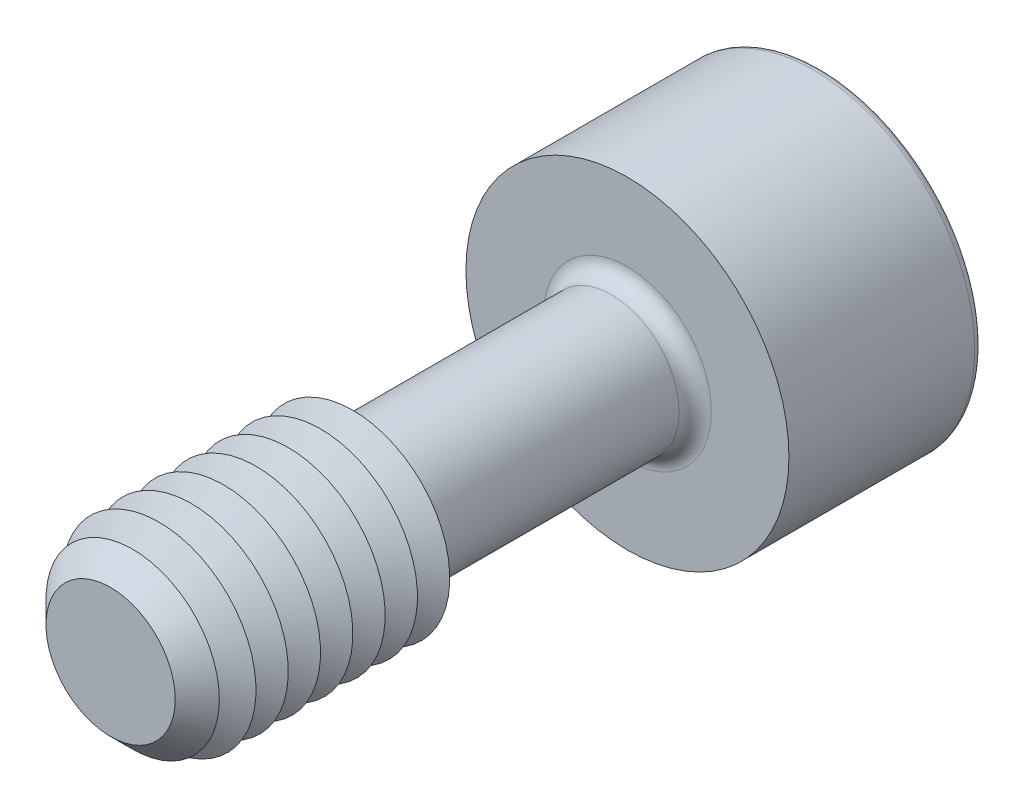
ISO-10303-21;
HEADER;
FILE_DESCRIPTION(('STEP AP214'),'2;1');
FILE_NAME('part.step','',(''),(''),'','','');
FILE_SCHEMA(('AUTOMOTIVE_DESIGN { 1 0 10303 214 1 1 1 1 }'));
ENDSEC;
DATA;
#1=APPLICATION_CONTEXT('core data for automotive mechanical design processes');
#2=APPLICATION_PROTOCOL_DEFINITION('international standard','automotive_design',2000,#1);
#3=PRODUCT_CONTEXT('',#1,'mechanical');
#4=PRODUCT('Part','Part','',(#3));
#5=PRODUCT_RELATED_PRODUCT_CATEGORY('part','',(#4));
#6=PRODUCT_DEFINITION_FORMATION('','',#4);
#7=PRODUCT_DEFINITION_CONTEXT('part definition',#1,'design');
#8=PRODUCT_DEFINITION('design','',#6,#7);
#9=PRODUCT_DEFINITION_SHAPE('','',#8);
#10=(LENGTH_UNIT() NAMED_UNIT(*) SI_UNIT(.MILLI.,.METRE.));
#11=(NAMED_UNIT(*) PLANE_ANGLE_UNIT() SI_UNIT($,.RADIAN.));
#12=(NAMED_UNIT(*) SI_UNIT($,.STERADIAN.) SOLID_ANGLE_UNIT());
#13=UNCERTAINTY_MEASURE_WITH_UNIT(LENGTH_MEASURE(1.E-05),#10,'distance_accuracy_value','');
#14=(GEOMETRIC_REPRESENTATION_CONTEXT(3) GLOBAL_UNCERTAINTY_ASSIGNED_CONTEXT((#13)) GLOBAL_UNIT_ASSIGNED_CONTEXT((#10,
#11,#12)) REPRESENTATION_CONTEXT('',''));
#15=CARTESIAN_POINT('',(0.,0.,0.));
#16=DIRECTION('',(0.,0.,1.));
#17=DIRECTION('',(1.,0.,0.));
#18=AXIS2_PLACEMENT_3D('',#15,#16,#17);
#19=CARTESIAN_POINT('',(-1.44337567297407,-2.5,-9.));
#20=DIRECTION('',(0.,0.,1.));
#21=DIRECTION('',(1.,0.,0.));
#22=AXIS2_PLACEMENT_3D('',#19,#20,#21);
#23=PLANE('',#22);
#24=DIRECTION('',(1.,0.,0.));
#25=VECTOR('',#24,1.);
#26=CARTESIAN_POINT('',(-1.44337567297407,-2.5,-9.));
#27=LINE('',#26,#25);
#28=CARTESIAN_POINT('',(0.,-2.5,-9.));
#29=VERTEX_POINT('',#28);
#30=CARTESIAN_POINT('',(1.44337567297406,-2.5,-9.));
#31=VERTEX_POINT('',#30);
#32=EDGE_CURVE('E729',#29,#31,#27,.T.);
#33=ORIENTED_EDGE('',*,*,#32,.F.);
#34=CARTESIAN_POINT('',(0.,0.,-9.));
#35=DIRECTION('',(0.,0.,1.));
#36=DIRECTION('',(0.,-1.,0.));
#37=AXIS2_PLACEMENT_3D('',#34,#35,#36);
#38=CIRCLE('',#37,2.5);
#39=CARTESIAN_POINT('',(2.1650635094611,-1.25,-9.));
#40=VERTEX_POINT('',#39);
#41=EDGE_CURVE('E53',#29,#40,#38,.T.);
#42=ORIENTED_EDGE('',*,*,#41,.T.);
#43=DIRECTION('',(0.5,0.866025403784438,0.));
#44=VECTOR('',#43,1.);
#45=CARTESIAN_POINT('',(1.44337567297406,-2.5,-9.));
#46=LINE('',#45,#44);
#47=EDGE_CURVE('E714',#31,#40,#46,.T.);
#48=ORIENTED_EDGE('',*,*,#47,.F.);
#49=EDGE_LOOP('',(#33,#42,#48));
#50=FACE_BOUND('',#49,.T.);
#51=ADVANCED_FACE('F41',(#50),#23,.F.);
#52=CARTESIAN_POINT('',(2.88675134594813,0.,-9.));
#53=VERTEX_POINT('',#52);
#54=EDGE_CURVE('E725',#40,#53,#46,.T.);
#55=ORIENTED_EDGE('',*,*,#54,.F.);
#56=CARTESIAN_POINT('',(2.1650635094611,1.25,-9.));
#57=VERTEX_POINT('',#56);
#58=EDGE_CURVE('E11',#40,#57,#38,.T.);
#59=ORIENTED_EDGE('',*,*,#58,.T.);
#60=DIRECTION('',(-0.5,0.866025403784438,0.));
#61=VECTOR('',#60,1.);
#62=CARTESIAN_POINT('',(2.88675134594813,0.,-9.));
#63=LINE('',#62,#61);
#64=EDGE_CURVE('E713',#53,#57,#63,.T.);
#65=ORIENTED_EDGE('',*,*,#64,.F.);
#66=EDGE_LOOP('',(#55,#59,#65));
#67=FACE_BOUND('',#66,.T.);
#68=ADVANCED_FACE('F133',(#67),#23,.F.);
#69=CARTESIAN_POINT('',(1.44337567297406,2.5,-9.));
#70=VERTEX_POINT('',#69);
#71=EDGE_CURVE('E708',#57,#70,#63,.T.);
#72=ORIENTED_EDGE('',*,*,#71,.F.);
#73=CARTESIAN_POINT('',(0.,2.5,-8.99999999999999));
#74=VERTEX_POINT('',#73);
#75=EDGE_CURVE('E51',#57,#74,#38,.T.);
#76=ORIENTED_EDGE('',*,*,#75,.T.);
#77=DIRECTION('',(-1.,0.,0.));
#78=VECTOR('',#77,1.);
#79=CARTESIAN_POINT('',(1.44337567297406,2.5,-9.));
#80=LINE('',#79,#78);
#81=EDGE_CURVE('E177',#70,#74,#80,.T.);
#82=ORIENTED_EDGE('',*,*,#81,.F.);
#83=EDGE_LOOP('',(#72,#76,#82));
#84=FACE_BOUND('',#83,.T.);
#85=ADVANCED_FACE('F139',(#84),#23,.F.);
#86=CARTESIAN_POINT('',(-1.44337567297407,2.5,-9.));
#87=VERTEX_POINT('',#86);
#88=EDGE_CURVE('E719',#74,#87,#80,.T.);
#89=ORIENTED_EDGE('',*,*,#88,.F.);
#90=CARTESIAN_POINT('',(-2.1650635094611,1.25,-9.));
#91=VERTEX_POINT('',#90);
#92=EDGE_CURVE('E264',#74,#91,#38,.T.);
#93=ORIENTED_EDGE('',*,*,#92,.T.);
#94=DIRECTION('',(-0.5,-0.866025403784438,0.));
#95=VECTOR('',#94,1.);
#96=CARTESIAN_POINT('',(-1.44337567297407,2.5,-9.));
#97=LINE('',#96,#95);
#98=EDGE_CURVE('E176',#87,#91,#97,.T.);
#99=ORIENTED_EDGE('',*,*,#98,.F.);
#100=EDGE_LOOP('',(#89,#93,#99));
#101=FACE_BOUND('',#100,.T.);
#102=ADVANCED_FACE('F157',(#101),#23,.F.);
#103=CARTESIAN_POINT('',(-2.88675134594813,0.,-9.));
#104=VERTEX_POINT('',#103);
#105=EDGE_CURVE('E170',#91,#104,#97,.T.);
#106=ORIENTED_EDGE('',*,*,#105,.F.);
#107=CARTESIAN_POINT('',(-2.1650635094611,-1.25,-9.));
#108=VERTEX_POINT('',#107);
#109=EDGE_CURVE('E172',#91,#108,#38,.T.);
#110=ORIENTED_EDGE('',*,*,#109,.T.);
#111=DIRECTION('',(0.5,-0.866025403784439,0.));
#112=VECTOR('',#111,1.);
#113=CARTESIAN_POINT('',(-2.88675134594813,0.,-9.));
#114=LINE('',#113,#112);
#115=EDGE_CURVE('E174',#104,#108,#114,.T.);
#116=ORIENTED_EDGE('',*,*,#115,.F.);
#117=EDGE_LOOP('',(#106,#110,#116));
#118=FACE_BOUND('',#117,.T.);
#119=ADVANCED_FACE('F146',(#118),#23,.F.);
#120=CARTESIAN_POINT('',(0.,0.,-14.));
#121=DIRECTION('',(0.,0.,-1.));
#122=DIRECTION('',(-1.,0.,0.));
#123=AXIS2_PLACEMENT_3D('',#120,#121,#122);
#124=PLANE('',#123);
#125=CARTESIAN_POINT('',(0.,0.,-14.));
#126=DIRECTION('',(0.,0.,-1.));
#127=DIRECTION('',(-1.,0.,0.));
#128=AXIS2_PLACEMENT_3D('',#125,#126,#127);
#129=CIRCLE('',#128,4.75);
#130=CARTESIAN_POINT('',(-4.75,0.,-14.));
#131=VERTEX_POINT('',#130);
#132=EDGE_CURVE('E250',#131,#131,#129,.T.);
#133=ORIENTED_EDGE('',*,*,#132,.T.);
#134=EDGE_LOOP('',(#133));
#135=FACE_BOUND('',#134,.T.);
#136=DIRECTION('',(-0.5,-0.866025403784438,0.));
#137=VECTOR('',#136,1.);
#138=CARTESIAN_POINT('',(-1.44337567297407,2.5,-14.));
#139=LINE('',#138,#137);
#140=CARTESIAN_POINT('',(-1.44337567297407,2.5,-14.));
#141=VERTEX_POINT('',#140);
#142=CARTESIAN_POINT('',(-2.88675134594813,0.,-14.));
#143=VERTEX_POINT('',#142);
#144=EDGE_CURVE('E212',#141,#143,#139,.T.);
#145=ORIENTED_EDGE('',*,*,#144,.T.);
#146=DIRECTION('',(0.5,-0.866025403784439,0.));
#147=VECTOR('',#146,1.);
#148=CARTESIAN_POINT('',(-2.88675134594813,0.,-14.));
#149=LINE('',#148,#147);
#150=CARTESIAN_POINT('',(-1.44337567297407,-2.5,-14.));
#151=VERTEX_POINT('',#150);
#152=EDGE_CURVE('E67',#143,#151,#149,.T.);
#153=ORIENTED_EDGE('',*,*,#152,.T.);
#154=DIRECTION('',(1.,0.,0.));
#155=VECTOR('',#154,1.);
#156=CARTESIAN_POINT('',(-1.44337567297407,-2.5,-14.));
#157=LINE('',#156,#155);
#158=CARTESIAN_POINT('',(1.44337567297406,-2.5,-14.));
#159=VERTEX_POINT('',#158);
#160=EDGE_CURVE('E196',#151,#159,#157,.T.);
#161=ORIENTED_EDGE('',*,*,#160,.T.);
#162=DIRECTION('',(0.5,0.866025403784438,0.));
#163=VECTOR('',#162,1.);
#164=CARTESIAN_POINT('',(1.44337567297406,-2.5,-14.));
#165=LINE('',#164,#163);
#166=CARTESIAN_POINT('',(2.88675134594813,0.,-14.));
#167=VERTEX_POINT('',#166);
#168=EDGE_CURVE('E200',#159,#167,#165,.T.);
#169=ORIENTED_EDGE('',*,*,#168,.T.);
#170=DIRECTION('',(-0.5,0.866025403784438,0.));
#171=VECTOR('',#170,1.);
#172=CARTESIAN_POINT('',(2.88675134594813,0.,-14.));
#173=LINE('',#172,#171);
#174=CARTESIAN_POINT('',(1.44337567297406,2.5,-14.));
#175=VERTEX_POINT('',#174);
#176=EDGE_CURVE('E204',#167,#175,#173,.T.);
#177=ORIENTED_EDGE('',*,*,#176,.T.);
#178=DIRECTION('',(-1.,0.,0.));
#179=VECTOR('',#178,1.);
#180=CARTESIAN_POINT('',(1.44337567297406,2.5,-14.));
#181=LINE('',#180,#179);
#182=EDGE_CURVE('E208',#175,#141,#181,.T.);
#183=ORIENTED_EDGE('',*,*,#182,.T.);
#184=EDGE_LOOP('',(#145,#153,#161,#169,#177,#183));
#185=FACE_BOUND('',#184,.T.);
#186=ADVANCED_FACE('F156',(#135,#185),#124,.T.);
#187=CARTESIAN_POINT('',(0.,0.,8.));
#188=DIRECTION('',(0.,0.,-1.));
#189=DIRECTION('',(-1.,0.,0.));
#190=AXIS2_PLACEMENT_3D('',#187,#188,#189);
#191=CYLINDRICAL_SURFACE('',#190,2.1);
#192=CARTESIAN_POINT('',(0.,0.,-7.5));
#193=DIRECTION('',(0.,0.,-1.));
#194=DIRECTION('',(-1.,0.,0.));
#195=AXIS2_PLACEMENT_3D('',#192,#193,#194);
#196=CIRCLE('',#195,2.1);
#197=CARTESIAN_POINT('',(-2.1,0.,-7.5));
#198=VERTEX_POINT('',#197);
#199=EDGE_CURVE('E247',#198,#198,#196,.F.);
#200=ORIENTED_EDGE('',*,*,#199,.T.);
#201=EDGE_LOOP('',(#200));
#202=FACE_BOUND('',#201,.T.);
#203=CARTESIAN_POINT('',(0.,0.,-0.0196152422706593));
#204=DIRECTION('',(0.,0.,-1.));
#205=DIRECTION('',(0.,1.,0.));
#206=AXIS2_PLACEMENT_3D('',#203,#204,#205);
#207=CIRCLE('',#206,2.1);
#208=CARTESIAN_POINT('',(0.,2.1,-0.019615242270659));
#209=VERTEX_POINT('',#208);
#210=EDGE_CURVE('E235',#209,#209,#207,.T.);
#211=ORIENTED_EDGE('',*,*,#210,.T.);
#212=EDGE_LOOP('',(#211));
#213=FACE_BOUND('',#212,.T.);
#214=ADVANCED_FACE('F163',(#202,#213),#191,.T.);
#215=CARTESIAN_POINT('',(0.,0.,-0.0196152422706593));
#216=DIRECTION('',(0.,0.,1.));
#217=DIRECTION('',(0.,-1.,0.));
#218=AXIS2_PLACEMENT_3D('',#215,#216,#217);
#219=CONICAL_SURFACE('',#218,2.1,1.0471975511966);
#220=CARTESIAN_POINT('',(0.,0.,0.5));
#221=DIRECTION('',(0.,0.,-1.));
#222=DIRECTION('',(-1.,0.,0.));
#223=AXIS2_PLACEMENT_3D('',#220,#221,#222);
#224=CIRCLE('',#223,3.);
#225=CARTESIAN_POINT('',(-3.,0.,0.5));
#226=VERTEX_POINT('',#225);
#227=EDGE_CURVE('E268',#226,#226,#224,.T.);
#228=ORIENTED_EDGE('',*,*,#227,.T.);
#229=EDGE_LOOP('',(#228));
#230=FACE_BOUND('',#229,.T.);
#231=ORIENTED_EDGE('',*,*,#210,.F.);
#232=EDGE_LOOP('',(#231));
#233=FACE_BOUND('',#232,.T.);
#234=ADVANCED_FACE('F485',(#230,#233),#219,.T.);
#235=CARTESIAN_POINT('',(0.,0.,-8.));
#236=DIRECTION('',(0.,0.,-1.));
#237=DIRECTION('',(-1.,0.,0.));
#238=AXIS2_PLACEMENT_3D('',#235,#236,#237);
#239=PLANE('',#238);
#240=CARTESIAN_POINT('',(0.,0.,-8.));
#241=DIRECTION('',(0.,0.,-1.));
#242=DIRECTION('',(-1.,0.,0.));
#243=AXIS2_PLACEMENT_3D('',#240,#241,#242);
#244=CIRCLE('',#243,2.6);
#245=CARTESIAN_POINT('',(-2.6,0.,-8.));
#246=VERTEX_POINT('',#245);
#247=EDGE_CURVE('E243',#246,#246,#244,.T.);
#248=ORIENTED_EDGE('',*,*,#247,.T.);
#249=EDGE_LOOP('',(#248));
#250=FACE_BOUND('',#249,.T.);
#251=CARTESIAN_POINT('',(0.,0.,-8.));
#252=DIRECTION('',(0.,0.,-1.));
#253=DIRECTION('',(-1.,0.,0.));
#254=AXIS2_PLACEMENT_3D('',#251,#252,#253);
#255=CIRCLE('',#254,5.);
#256=CARTESIAN_POINT('',(-5.,0.,-8.));
#257=VERTEX_POINT('',#256);
#258=EDGE_CURVE('E231',#257,#257,#255,.T.);
#259=ORIENTED_EDGE('',*,*,#258,.F.);
#260=EDGE_LOOP('',(#259));
#261=FACE_BOUND('',#260,.T.);
#262=ADVANCED_FACE('F478',(#250,#261),#239,.F.);
#263=CARTESIAN_POINT('',(0.,0.,-14.));
#264=DIRECTION('',(0.,0.,1.));
#265=DIRECTION('',(1.,0.,0.));
#266=AXIS2_PLACEMENT_3D('',#263,#264,#265);
#267=CYLINDRICAL_SURFACE('',#266,5.);
#268=CARTESIAN_POINT('',(0.,0.,-13.75));
#269=DIRECTION('',(0.,0.,-1.));
#270=DIRECTION('',(-1.,0.,0.));
#271=AXIS2_PLACEMENT_3D('',#268,#269,#270);
#272=CIRCLE('',#271,5.);
#273=CARTESIAN_POINT('',(-5.,0.,-13.75));
#274=VERTEX_POINT('',#273);
#275=EDGE_CURVE('E253',#274,#274,#272,.F.);
#276=ORIENTED_EDGE('',*,*,#275,.T.);
#277=EDGE_LOOP('',(#276));
#278=FACE_BOUND('',#277,.T.);
#279=ORIENTED_EDGE('',*,*,#258,.T.);
#280=EDGE_LOOP('',(#279));
#281=FACE_BOUND('',#280,.T.);
#282=ADVANCED_FACE('F484',(#278,#281),#267,.T.);
#283=CARTESIAN_POINT('',(-2.88675134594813,0.,-9.));
#284=DIRECTION('',(0.866025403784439,0.5,0.));
#285=DIRECTION('',(-0.5,0.866025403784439,0.));
#286=AXIS2_PLACEMENT_3D('',#283,#284,#285);
#287=PLANE('',#286);
#288=ORIENTED_EDGE('',*,*,#152,.F.);
#289=DIRECTION('',(0.,0.,-1.));
#290=VECTOR('',#289,1.);
#291=CARTESIAN_POINT('',(-2.88675134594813,0.,-9.));
#292=LINE('',#291,#290);
#293=EDGE_CURVE('E186',#104,#143,#292,.T.);
#294=ORIENTED_EDGE('',*,*,#293,.F.);
#295=ORIENTED_EDGE('',*,*,#115,.T.);
#296=CARTESIAN_POINT('',(-1.44337567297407,-2.5,-9.));
#297=VERTEX_POINT('',#296);
#298=EDGE_CURVE('E215',#108,#297,#114,.T.);
#299=ORIENTED_EDGE('',*,*,#298,.T.);
#300=DIRECTION('',(0.,0.,-1.));
#301=VECTOR('',#300,1.);
#302=CARTESIAN_POINT('',(-1.44337567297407,-2.5,-9.));
#303=LINE('',#302,#301);
#304=EDGE_CURVE('E228',#297,#151,#303,.T.);
#305=ORIENTED_EDGE('',*,*,#304,.T.);
#306=EDGE_LOOP('',(#288,#294,#295,#299,#305));
#307=FACE_BOUND('',#306,.T.);
#308=ADVANCED_FACE('F496',(#307),#287,.T.);
#309=CARTESIAN_POINT('',(-1.44337567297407,-2.5,-9.));
#310=DIRECTION('',(0.,1.,0.));
#311=DIRECTION('',(-1.,0.,0.));
#312=AXIS2_PLACEMENT_3D('',#309,#310,#311);
#313=PLANE('',#312);
#314=ORIENTED_EDGE('',*,*,#160,.F.);
#315=ORIENTED_EDGE('',*,*,#304,.F.);
#316=EDGE_CURVE('E726',#297,#29,#27,.T.);
#317=ORIENTED_EDGE('',*,*,#316,.T.);
#318=ORIENTED_EDGE('',*,*,#32,.T.);
#319=DIRECTION('',(0.,0.,-1.));
#320=VECTOR('',#319,1.);
#321=CARTESIAN_POINT('',(1.44337567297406,-2.5,-9.));
#322=LINE('',#321,#320);
#323=EDGE_CURVE('E225',#31,#159,#322,.T.);
#324=ORIENTED_EDGE('',*,*,#323,.T.);
#325=EDGE_LOOP('',(#314,#315,#317,#318,#324));
#326=FACE_BOUND('',#325,.T.);
#327=ADVANCED_FACE('F512',(#326),#313,.T.);
#328=CARTESIAN_POINT('',(1.44337567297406,-2.5,-9.));
#329=DIRECTION('',(-0.866025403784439,0.5,0.));
#330=DIRECTION('',(-0.5,-0.866025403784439,0.));
#331=AXIS2_PLACEMENT_3D('',#328,#329,#330);
#332=PLANE('',#331);
#333=ORIENTED_EDGE('',*,*,#168,.F.);
#334=ORIENTED_EDGE('',*,*,#323,.F.);
#335=ORIENTED_EDGE('',*,*,#47,.T.);
#336=ORIENTED_EDGE('',*,*,#54,.T.);
#337=DIRECTION('',(0.,0.,-1.));
#338=VECTOR('',#337,1.);
#339=CARTESIAN_POINT('',(2.88675134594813,0.,-9.));
#340=LINE('',#339,#338);
#341=EDGE_CURVE('E222',#53,#167,#340,.T.);
#342=ORIENTED_EDGE('',*,*,#341,.T.);
#343=EDGE_LOOP('',(#333,#334,#335,#336,#342));
#344=FACE_BOUND('',#343,.T.);
#345=ADVANCED_FACE('F522',(#344),#332,.T.);
#346=CARTESIAN_POINT('',(2.88675134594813,0.,-9.));
#347=DIRECTION('',(-0.866025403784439,-0.5,0.));
#348=DIRECTION('',(0.5,-0.866025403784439,0.));
#349=AXIS2_PLACEMENT_3D('',#346,#347,#348);
#350=PLANE('',#349);
#351=ORIENTED_EDGE('',*,*,#176,.F.);
#352=ORIENTED_EDGE('',*,*,#341,.F.);
#353=ORIENTED_EDGE('',*,*,#64,.T.);
#354=ORIENTED_EDGE('',*,*,#71,.T.);
#355=DIRECTION('',(0.,0.,-1.));
#356=VECTOR('',#355,1.);
#357=CARTESIAN_POINT('',(1.44337567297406,2.5,-9.));
#358=LINE('',#357,#356);
#359=EDGE_CURVE('E219',#70,#175,#358,.T.);
#360=ORIENTED_EDGE('',*,*,#359,.T.);
#361=EDGE_LOOP('',(#351,#352,#353,#354,#360));
#362=FACE_BOUND('',#361,.T.);
#363=ADVANCED_FACE('F532',(#362),#350,.T.);
#364=CARTESIAN_POINT('',(1.44337567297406,2.5,-9.));
#365=DIRECTION('',(0.,-1.,0.));
#366=DIRECTION('',(0.,0.,-1.));
#367=AXIS2_PLACEMENT_3D('',#364,#365,#366);
#368=PLANE('',#367);
#369=ORIENTED_EDGE('',*,*,#182,.F.);
#370=ORIENTED_EDGE('',*,*,#359,.F.);
#371=ORIENTED_EDGE('',*,*,#81,.T.);
#372=ORIENTED_EDGE('',*,*,#88,.T.);
#373=DIRECTION('',(0.,0.,-1.));
#374=VECTOR('',#373,1.);
#375=CARTESIAN_POINT('',(-1.44337567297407,2.5,-9.));
#376=LINE('',#375,#374);
#377=EDGE_CURVE('E182',#87,#141,#376,.T.);
#378=ORIENTED_EDGE('',*,*,#377,.T.);
#379=EDGE_LOOP('',(#369,#370,#371,#372,#378));
#380=FACE_BOUND('',#379,.T.);
#381=ADVANCED_FACE('F152',(#380),#368,.T.);
#382=CARTESIAN_POINT('',(-1.44337567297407,2.5,-9.));
#383=DIRECTION('',(0.866025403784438,-0.5,0.));
#384=DIRECTION('',(0.5,0.866025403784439,0.));
#385=AXIS2_PLACEMENT_3D('',#382,#383,#384);
#386=PLANE('',#385);
#387=ORIENTED_EDGE('',*,*,#144,.F.);
#388=ORIENTED_EDGE('',*,*,#377,.F.);
#389=ORIENTED_EDGE('',*,*,#98,.T.);
#390=ORIENTED_EDGE('',*,*,#105,.T.);
#391=ORIENTED_EDGE('',*,*,#293,.T.);
#392=EDGE_LOOP('',(#387,#388,#389,#390,#391));
#393=FACE_BOUND('',#392,.T.);
#394=ADVANCED_FACE('F144',(#393),#386,.T.);
#395=ORIENTED_EDGE('',*,*,#298,.F.);
#396=EDGE_CURVE('E256',#108,#29,#38,.T.);
#397=ORIENTED_EDGE('',*,*,#396,.T.);
#398=ORIENTED_EDGE('',*,*,#316,.F.);
#399=EDGE_LOOP('',(#395,#397,#398));
#400=FACE_BOUND('',#399,.T.);
#401=ADVANCED_FACE('F135',(#400),#23,.F.);
#402=CARTESIAN_POINT('',(0.,0.,-7.5));
#403=DIRECTION('',(0.,0.,-1.));
#404=DIRECTION('',(-1.,0.,0.));
#405=AXIS2_PLACEMENT_3D('',#402,#403,#404);
#406=TOROIDAL_SURFACE('',#405,2.6,0.5);
#407=ORIENTED_EDGE('',*,*,#199,.F.);
#408=EDGE_LOOP('',(#407));
#409=FACE_BOUND('',#408,.T.);
#410=ORIENTED_EDGE('',*,*,#247,.F.);
#411=EDGE_LOOP('',(#410));
#412=FACE_BOUND('',#411,.T.);
#413=ADVANCED_FACE('F129',(#409,#412),#406,.F.);
#414=CARTESIAN_POINT('',(0.,0.,-13.75));
#415=DIRECTION('',(0.,0.,-1.));
#416=DIRECTION('',(-1.,0.,0.));
#417=AXIS2_PLACEMENT_3D('',#414,#415,#416);
#418=TOROIDAL_SURFACE('',#417,4.75,0.25);
#419=ORIENTED_EDGE('',*,*,#275,.F.);
#420=EDGE_LOOP('',(#419));
#421=FACE_BOUND('',#420,.T.);
#422=ORIENTED_EDGE('',*,*,#132,.F.);
#423=EDGE_LOOP('',(#422));
#424=FACE_BOUND('',#423,.T.);
#425=ADVANCED_FACE('F43',(#421,#424),#418,.T.);
#426=CARTESIAN_POINT('',(0.,0.,-7.55662432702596));
#427=DIRECTION('',(0.,0.,-1.));
#428=DIRECTION('',(0.,1.,0.));
#429=AXIS2_PLACEMENT_3D('',#426,#427,#428);
#430=CONICAL_SURFACE('',#429,0.,1.0471975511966);
#431=ORIENTED_EDGE('',*,*,#41,.F.);
#432=ORIENTED_EDGE('',*,*,#396,.F.);
#433=ORIENTED_EDGE('',*,*,#109,.F.);
#434=ORIENTED_EDGE('',*,*,#92,.F.);
#435=ORIENTED_EDGE('',*,*,#75,.F.);
#436=ORIENTED_EDGE('',*,*,#58,.F.);
#437=EDGE_LOOP('',(#431,#432,#433,#434,#435,#436));
#438=FACE_BOUND('',#437,.T.);
#439=CARTESIAN_POINT('',(0.,0.,-7.55662432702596));
#440=VERTEX_POINT('',#439);
#441=VERTEX_LOOP('',#440);
#442=FACE_BOUND('',#441,.T.);
#443=ADVANCED_FACE('F118',(#438,#442),#430,.F.);
#444=CARTESIAN_POINT('',(0.,0.,1.));
#445=DIRECTION('',(0.,0.,-1.));
#446=DIRECTION('',(-1.,0.,0.));
#447=AXIS2_PLACEMENT_3D('',#444,#445,#446);
#448=CONICAL_SURFACE('',#447,2.13397459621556,1.0471975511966);
#449=ORIENTED_EDGE('',*,*,#227,.F.);
#450=EDGE_LOOP('',(#449));
#451=FACE_BOUND('',#450,.T.);
#452=CARTESIAN_POINT('',(0.,0.,1.));
#453=DIRECTION('',(0.,0.,-1.));
#454=DIRECTION('',(-1.,0.,0.));
#455=AXIS2_PLACEMENT_3D('',#452,#453,#454);
#456=CIRCLE('',#455,2.13397459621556);
#457=CARTESIAN_POINT('',(-2.13397459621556,0.,1.));
#458=VERTEX_POINT('',#457);
#459=EDGE_CURVE('E275',#458,#458,#456,.T.);
#460=ORIENTED_EDGE('',*,*,#459,.T.);
#461=EDGE_LOOP('',(#460));
#462=FACE_BOUND('',#461,.T.);
#463=ADVANCED_FACE('F120',(#451,#462),#448,.T.);
#464=CARTESIAN_POINT('',(0.,0.,1.5));
#465=DIRECTION('',(0.,0.,1.));
#466=DIRECTION('',(1.,0.,0.));
#467=AXIS2_PLACEMENT_3D('',#464,#465,#466);
#468=CONICAL_SURFACE('',#467,3.,1.0471975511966);
#469=ORIENTED_EDGE('',*,*,#459,.F.);
#470=EDGE_LOOP('',(#469));
#471=FACE_BOUND('',#470,.T.);
#472=CARTESIAN_POINT('',(0.,0.,1.5));
#473=DIRECTION('',(0.,0.,-1.));
#474=DIRECTION('',(-1.,0.,0.));
#475=AXIS2_PLACEMENT_3D('',#472,#473,#474);
#476=CIRCLE('',#475,3.);
#477=CARTESIAN_POINT('',(-3.,0.,1.5));
#478=VERTEX_POINT('',#477);
#479=EDGE_CURVE('E279',#478,#478,#476,.T.);
#480=ORIENTED_EDGE('',*,*,#479,.T.);
#481=EDGE_LOOP('',(#480));
#482=FACE_BOUND('',#481,.T.);
#483=ADVANCED_FACE('F126',(#471,#482),#468,.T.);
#484=CARTESIAN_POINT('',(0.,0.,2.));
#485=DIRECTION('',(0.,0.,-1.));
#486=DIRECTION('',(-1.,0.,0.));
#487=AXIS2_PLACEMENT_3D('',#484,#485,#486);
#488=CONICAL_SURFACE('',#487,2.13397459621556,1.0471975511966);
#489=ORIENTED_EDGE('',*,*,#479,.F.);
#490=EDGE_LOOP('',(#489));
#491=FACE_BOUND('',#490,.T.);
#492=CARTESIAN_POINT('',(0.,0.,2.));
#493=DIRECTION('',(0.,0.,-1.));
#494=DIRECTION('',(-1.,0.,0.));
#495=AXIS2_PLACEMENT_3D('',#492,#493,#494);
#496=CIRCLE('',#495,2.13397459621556);
#497=CARTESIAN_POINT('',(-2.13397459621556,0.,2.));
#498=VERTEX_POINT('',#497);
#499=EDGE_CURVE('E285',#498,#498,#496,.T.);
#500=ORIENTED_EDGE('',*,*,#499,.T.);
#501=EDGE_LOOP('',(#500));
#502=FACE_BOUND('',#501,.T.);
#503=ADVANCED_FACE('F382',(#491,#502),#488,.T.);
#504=CARTESIAN_POINT('',(0.,0.,2.5));
#505=DIRECTION('',(0.,0.,1.));
#506=DIRECTION('',(1.,0.,0.));
#507=AXIS2_PLACEMENT_3D('',#504,#505,#506);
#508=CONICAL_SURFACE('',#507,3.,1.0471975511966);
#509=ORIENTED_EDGE('',*,*,#499,.F.);
#510=EDGE_LOOP('',(#509));
#511=FACE_BOUND('',#510,.T.);
#512=CARTESIAN_POINT('',(0.,0.,2.5));
#513=DIRECTION('',(0.,0.,-1.));
#514=DIRECTION('',(-1.,0.,0.));
#515=AXIS2_PLACEMENT_3D('',#512,#513,#514);
#516=CIRCLE('',#515,3.);
#517=CARTESIAN_POINT('',(-3.,0.,2.5));
#518=VERTEX_POINT('',#517);
#519=EDGE_CURVE('E289',#518,#518,#516,.T.);
#520=ORIENTED_EDGE('',*,*,#519,.T.);
#521=EDGE_LOOP('',(#520));
#522=FACE_BOUND('',#521,.T.);
#523=ADVANCED_FACE('F378',(#511,#522),#508,.T.);
#524=CARTESIAN_POINT('',(0.,0.,3.));
#525=DIRECTION('',(0.,0.,-1.));
#526=DIRECTION('',(-1.,0.,0.));
#527=AXIS2_PLACEMENT_3D('',#524,#525,#526);
#528=CONICAL_SURFACE('',#527,2.13397459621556,1.0471975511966);
#529=ORIENTED_EDGE('',*,*,#519,.F.);
#530=EDGE_LOOP('',(#529));
#531=FACE_BOUND('',#530,.T.);
#532=CARTESIAN_POINT('',(0.,0.,3.));
#533=DIRECTION('',(0.,0.,-1.));
#534=DIRECTION('',(-1.,0.,0.));
#535=AXIS2_PLACEMENT_3D('',#532,#533,#534);
#536=CIRCLE('',#535,2.13397459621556);
#537=CARTESIAN_POINT('',(-2.13397459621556,0.,3.));
#538=VERTEX_POINT('',#537);
#539=EDGE_CURVE('E293',#538,#538,#536,.T.);
#540=ORIENTED_EDGE('',*,*,#539,.T.);
#541=EDGE_LOOP('',(#540));
#542=FACE_BOUND('',#541,.T.);
#543=ADVANCED_FACE('F374',(#531,#542),#528,.T.);
#544=CARTESIAN_POINT('',(0.,0.,3.5));
#545=DIRECTION('',(0.,0.,1.));
#546=DIRECTION('',(1.,0.,0.));
#547=AXIS2_PLACEMENT_3D('',#544,#545,#546);
#548=CONICAL_SURFACE('',#547,3.,1.0471975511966);
#549=ORIENTED_EDGE('',*,*,#539,.F.);
#550=EDGE_LOOP('',(#549));
#551=FACE_BOUND('',#550,.T.);
#552=CARTESIAN_POINT('',(0.,0.,3.5));
#553=DIRECTION('',(0.,0.,-1.));
#554=DIRECTION('',(-1.,0.,0.));
#555=AXIS2_PLACEMENT_3D('',#552,#553,#554);
#556=CIRCLE('',#555,3.);
#557=CARTESIAN_POINT('',(-3.,0.,3.5));
#558=VERTEX_POINT('',#557);
#559=EDGE_CURVE('E297',#558,#558,#556,.T.);
#560=ORIENTED_EDGE('',*,*,#559,.T.);
#561=EDGE_LOOP('',(#560));
#562=FACE_BOUND('',#561,.T.);
#563=ADVANCED_FACE('F370',(#551,#562),#548,.T.);
#564=CARTESIAN_POINT('',(0.,0.,4.));
#565=DIRECTION('',(0.,0.,-1.));
#566=DIRECTION('',(-1.,0.,0.));
#567=AXIS2_PLACEMENT_3D('',#564,#565,#566);
#568=CONICAL_SURFACE('',#567,2.13397459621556,1.0471975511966);
#569=ORIENTED_EDGE('',*,*,#559,.F.);
#570=EDGE_LOOP('',(#569));
#571=FACE_BOUND('',#570,.T.);
#572=CARTESIAN_POINT('',(0.,0.,4.));
#573=DIRECTION('',(0.,0.,-1.));
#574=DIRECTION('',(-1.,0.,0.));
#575=AXIS2_PLACEMENT_3D('',#572,#573,#574);
#576=CIRCLE('',#575,2.13397459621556);
#577=CARTESIAN_POINT('',(-2.13397459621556,0.,4.));
#578=VERTEX_POINT('',#577);
#579=EDGE_CURVE('E301',#578,#578,#576,.T.);
#580=ORIENTED_EDGE('',*,*,#579,.T.);
#581=EDGE_LOOP('',(#580));
#582=FACE_BOUND('',#581,.T.);
#583=ADVANCED_FACE('F366',(#571,#582),#568,.T.);
#584=CARTESIAN_POINT('',(0.,0.,4.5));
#585=DIRECTION('',(0.,0.,1.));
#586=DIRECTION('',(1.,0.,0.));
#587=AXIS2_PLACEMENT_3D('',#584,#585,#586);
#588=CONICAL_SURFACE('',#587,3.,1.0471975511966);
#589=ORIENTED_EDGE('',*,*,#579,.F.);
#590=EDGE_LOOP('',(#589));
#591=FACE_BOUND('',#590,.T.);
#592=CARTESIAN_POINT('',(0.,0.,4.5));
#593=DIRECTION('',(0.,0.,-1.));
#594=DIRECTION('',(-1.,0.,0.));
#595=AXIS2_PLACEMENT_3D('',#592,#593,#594);
#596=CIRCLE('',#595,3.);
#597=CARTESIAN_POINT('',(-3.,0.,4.5));
#598=VERTEX_POINT('',#597);
#599=EDGE_CURVE('E305',#598,#598,#596,.T.);
#600=ORIENTED_EDGE('',*,*,#599,.T.);
#601=EDGE_LOOP('',(#600));
#602=FACE_BOUND('',#601,.T.);
#603=ADVANCED_FACE('F362',(#591,#602),#588,.T.);
#604=CARTESIAN_POINT('',(0.,0.,5.));
#605=DIRECTION('',(0.,0.,-1.));
#606=DIRECTION('',(-1.,0.,0.));
#607=AXIS2_PLACEMENT_3D('',#604,#605,#606);
#608=CONICAL_SURFACE('',#607,2.13397459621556,1.0471975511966);
#609=ORIENTED_EDGE('',*,*,#599,.F.);
#610=EDGE_LOOP('',(#609));
#611=FACE_BOUND('',#610,.T.);
#612=CARTESIAN_POINT('',(0.,0.,5.));
#613=DIRECTION('',(0.,0.,-1.));
#614=DIRECTION('',(-1.,0.,0.));
#615=AXIS2_PLACEMENT_3D('',#612,#613,#614);
#616=CIRCLE('',#615,2.13397459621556);
#617=CARTESIAN_POINT('',(-2.13397459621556,0.,5.));
#618=VERTEX_POINT('',#617);
#619=EDGE_CURVE('E309',#618,#618,#616,.T.);
#620=ORIENTED_EDGE('',*,*,#619,.T.);
#621=EDGE_LOOP('',(#620));
#622=FACE_BOUND('',#621,.T.);
#623=ADVANCED_FACE('F358',(#611,#622),#608,.T.);
#624=CARTESIAN_POINT('',(0.,0.,5.5));
#625=DIRECTION('',(0.,0.,1.));
#626=DIRECTION('',(1.,0.,0.));
#627=AXIS2_PLACEMENT_3D('',#624,#625,#626);
#628=CONICAL_SURFACE('',#627,3.,1.0471975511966);
#629=ORIENTED_EDGE('',*,*,#619,.F.);
#630=EDGE_LOOP('',(#629));
#631=FACE_BOUND('',#630,.T.);
#632=CARTESIAN_POINT('',(0.,0.,5.5));
#633=DIRECTION('',(0.,0.,-1.));
#634=DIRECTION('',(-1.,0.,0.));
#635=AXIS2_PLACEMENT_3D('',#632,#633,#634);
#636=CIRCLE('',#635,3.);
#637=CARTESIAN_POINT('',(-3.,0.,5.5));
#638=VERTEX_POINT('',#637);
#639=EDGE_CURVE('E313',#638,#638,#636,.T.);
#640=ORIENTED_EDGE('',*,*,#639,.T.);
#641=EDGE_LOOP('',(#640));
#642=FACE_BOUND('',#641,.T.);
#643=ADVANCED_FACE('F354',(#631,#642),#628,.T.);
#644=CARTESIAN_POINT('',(0.,0.,6.));
#645=DIRECTION('',(0.,0.,-1.));
#646=DIRECTION('',(-1.,0.,0.));
#647=AXIS2_PLACEMENT_3D('',#644,#645,#646);
#648=CONICAL_SURFACE('',#647,2.13397459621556,1.0471975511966);
#649=ORIENTED_EDGE('',*,*,#639,.F.);
#650=EDGE_LOOP('',(#649));
#651=FACE_BOUND('',#650,.T.);
#652=CARTESIAN_POINT('',(0.,0.,6.));
#653=DIRECTION('',(0.,0.,-1.));
#654=DIRECTION('',(-1.,0.,0.));
#655=AXIS2_PLACEMENT_3D('',#652,#653,#654);
#656=CIRCLE('',#655,2.13397459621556);
#657=CARTESIAN_POINT('',(-2.13397459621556,0.,6.));
#658=VERTEX_POINT('',#657);
#659=EDGE_CURVE('E317',#658,#658,#656,.T.);
#660=ORIENTED_EDGE('',*,*,#659,.T.);
#661=EDGE_LOOP('',(#660));
#662=FACE_BOUND('',#661,.T.);
#663=ADVANCED_FACE('F350',(#651,#662),#648,.T.);
#664=CARTESIAN_POINT('',(0.,0.,6.5));
#665=DIRECTION('',(0.,0.,1.));
#666=DIRECTION('',(1.,0.,0.));
#667=AXIS2_PLACEMENT_3D('',#664,#665,#666);
#668=CONICAL_SURFACE('',#667,3.,1.0471975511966);
#669=ORIENTED_EDGE('',*,*,#659,.F.);
#670=EDGE_LOOP('',(#669));
#671=FACE_BOUND('',#670,.T.);
#672=CARTESIAN_POINT('',(0.,0.,6.5));
#673=DIRECTION('',(0.,0.,-1.));
#674=DIRECTION('',(-1.,0.,0.));
#675=AXIS2_PLACEMENT_3D('',#672,#673,#674);
#676=CIRCLE('',#675,3.);
#677=CARTESIAN_POINT('',(-3.,0.,6.5));
#678=VERTEX_POINT('',#677);
#679=EDGE_CURVE('E321',#678,#678,#676,.T.);
#680=ORIENTED_EDGE('',*,*,#679,.T.);
#681=EDGE_LOOP('',(#680));
#682=FACE_BOUND('',#681,.T.);
#683=ADVANCED_FACE('F343',(#671,#682),#668,.T.);
#684=CARTESIAN_POINT('',(0.,0.,7.));
#685=DIRECTION('',(0.,0.,-1.));
#686=DIRECTION('',(-1.,0.,0.));
#687=AXIS2_PLACEMENT_3D('',#684,#685,#686);
#688=CONICAL_SURFACE('',#687,2.13397459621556,1.0471975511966);
#689=ORIENTED_EDGE('',*,*,#679,.F.);
#690=EDGE_LOOP('',(#689));
#691=FACE_BOUND('',#690,.T.);
#692=CARTESIAN_POINT('',(0.,0.,7.));
#693=DIRECTION('',(0.,0.,-1.));
#694=DIRECTION('',(-1.,0.,0.));
#695=AXIS2_PLACEMENT_3D('',#692,#693,#694);
#696=CIRCLE('',#695,2.13397459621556);
#697=CARTESIAN_POINT('',(-2.13397459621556,0.,7.));
#698=VERTEX_POINT('',#697);
#699=EDGE_CURVE('E325',#698,#698,#696,.T.);
#700=ORIENTED_EDGE('',*,*,#699,.T.);
#701=EDGE_LOOP('',(#700));
#702=FACE_BOUND('',#701,.T.);
#703=ADVANCED_FACE('F329',(#691,#702),#688,.T.);
#704=CARTESIAN_POINT('',(0.,0.,7.5));
#705=DIRECTION('',(0.,0.,1.));
#706=DIRECTION('',(1.,0.,0.));
#707=AXIS2_PLACEMENT_3D('',#704,#705,#706);
#708=CONICAL_SURFACE('',#707,3.,1.0471975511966);
#709=CARTESIAN_POINT('',(0.,0.,7.31698729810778));
#710=DIRECTION('',(0.,0.,1.));
#711=DIRECTION('',(1.,0.,0.));
#712=AXIS2_PLACEMENT_3D('',#709,#710,#711);
#713=CIRCLE('',#712,2.68301270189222);
#714=CARTESIAN_POINT('',(2.68301270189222,0.,7.31698729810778));
#715=VERTEX_POINT('',#714);
#716=EDGE_CURVE('E45',#715,#715,#713,.F.);
#717=ORIENTED_EDGE('',*,*,#716,.T.);
#718=EDGE_LOOP('',(#717));
#719=FACE_BOUND('',#718,.T.);
#720=ORIENTED_EDGE('',*,*,#699,.F.);
#721=EDGE_LOOP('',(#720));
#722=FACE_BOUND('',#721,.T.);
#723=ADVANCED_FACE('F331',(#719,#722),#708,.T.);
#724=CARTESIAN_POINT('',(0.,0.,8.));
#725=DIRECTION('',(0.,0.,1.));
#726=DIRECTION('',(1.,0.,0.));
#727=AXIS2_PLACEMENT_3D('',#724,#725,#726);
#728=PLANE('',#727);
#729=CARTESIAN_POINT('',(0.,0.,8.));
#730=DIRECTION('',(0.,0.,1.));
#731=DIRECTION('',(1.,0.,0.));
#732=AXIS2_PLACEMENT_3D('',#729,#730,#731);
#733=CIRCLE('',#732,2.);
#734=CARTESIAN_POINT('',(2.,0.,8.));
#735=VERTEX_POINT('',#734);
#736=EDGE_CURVE('E239',#735,#735,#733,.T.);
#737=ORIENTED_EDGE('',*,*,#736,.T.);
#738=EDGE_LOOP('',(#737));
#739=FACE_BOUND('',#738,.T.);
#740=ADVANCED_FACE('F333',(#739),#728,.T.);
#741=CARTESIAN_POINT('',(0.,0.,7.));
#742=DIRECTION('',(0.,0.,-1.));
#743=DIRECTION('',(0.,1.,0.));
#744=AXIS2_PLACEMENT_3D('',#741,#742,#743);
#745=CONICAL_SURFACE('',#744,3.,0.78539816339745);
#746=ORIENTED_EDGE('',*,*,#716,.F.);
#747=EDGE_LOOP('',(#746));
#748=FACE_BOUND('',#747,.T.);
#749=ORIENTED_EDGE('',*,*,#736,.F.);
#750=EDGE_LOOP('',(#749));
#751=FACE_BOUND('',#750,.T.);
#752=ADVANCED_FACE('F340',(#748,#751),#745,.T.);
#753=CLOSED_SHELL('',(#51,#68,#85,#102,#119,#186,#214,#234,#262,#282,#308,#327,#345,#363,#381,
#394,#401,#413,#425,#443,#463,#483,#503,#523,#543,#563,#583,#603,#623,#643,#663,#683,#703,#723,
#740,#752));
#754=MANIFOLD_SOLID_BREP('B2',#753);
#755=ADVANCED_BREP_SHAPE_REPRESENTATION('',(#18,#754),#14);
#756=SHAPE_DEFINITION_REPRESENTATION(#9,#755);
ENDSEC;
END-ISO-10303-21;
